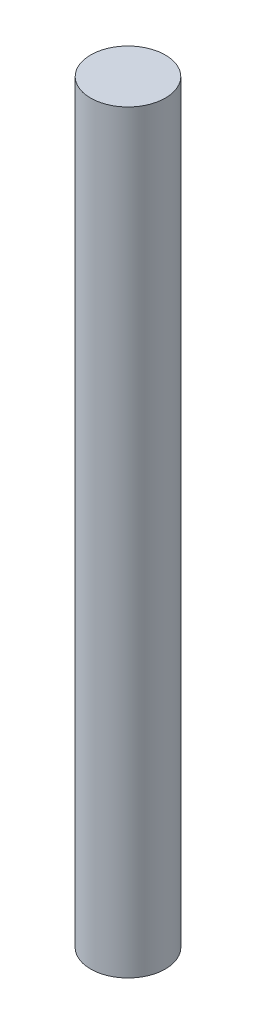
from build123d import *

# Parameters (mm, degrees)
SKETCH1_R           = 5
BOSS_EXTRUDE1_DEPTH = 100.96


with BuildPart() as part:
    # Sketch1 → Boss-Extrude1 (new body)
    with BuildSketch(Plane(origin=(0, 0, 0), x_dir=(1, 0, 0), z_dir=(0, 1, 0))):
        with Locations(Location((0, 0, 0), (0, 0, 270))):
            Circle(SKETCH1_R)
    extrude(amount=BOSS_EXTRUDE1_DEPTH)


solid = part.part
